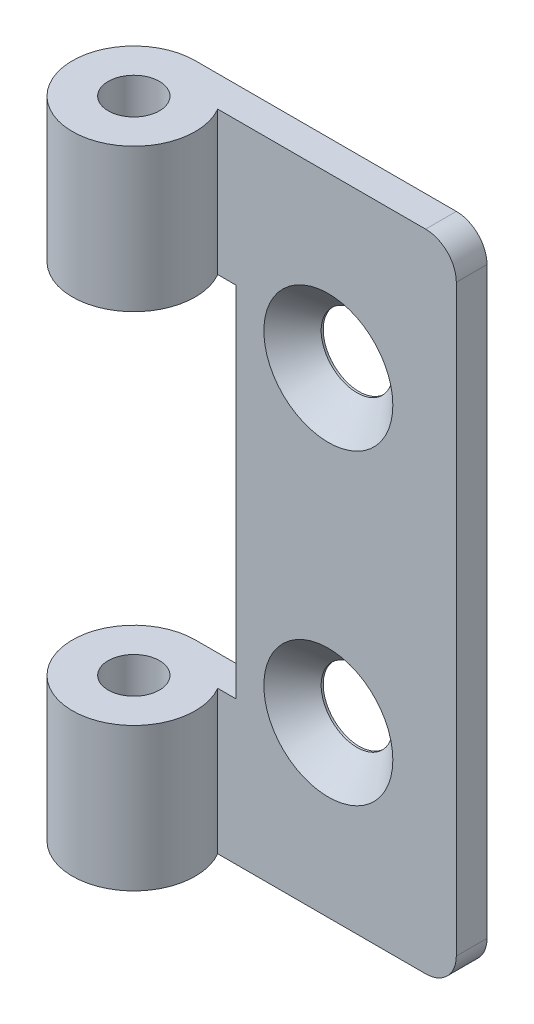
from build123d import *

# Parameters (mm, degrees)
EXTRUDE_1_DEPTH             = 31.5
SKETCH_2_W                  = 18.001338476
SKETCH_2_H                  = 35
CUT_EXTRUDE_2_DEPTH         = 45.141816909
FILLET_2_R                  = 3
HOLE_WIZARD_M6_1_AT_2_COUNT = 2
HOLE_WIZARD_M6_1_AT_2_PITCH = 30
SKETCH_5_R                  = 2.5
CUT_EXTRUDE_3_DEPTH         = 70.406411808


with BuildPart() as part:
    # Sketch 1 → Extrude 1 (new, symmetric)
    with BuildSketch(Plane(origin=(0, 0, 0), x_dir=(1, 0, 0), z_dir=(0, 1, 0))):
        with BuildLine():
            Line((0, 6), (28.5, 6))
            Line((28.5, 6), (28.5, 3))
            Line((28.5, 3), (5.196152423, 3))
            ThreePointArc((5.196152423, 3), (-3, -5.196152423), (0, 6))
        make_face()
    extrude(amount=EXTRUDE_1_DEPTH, both=True)

    # Sketch 2 → Cut-Extrude 2 (cut, through all)
    with BuildSketch(Plane(origin=(0, 0, -6), x_dir=(-1, 0, 0), z_dir=(0, 0, -1))):
        with Locations((2.000669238, 0)):
            Rectangle(SKETCH_2_W, SKETCH_2_H)
    extrude(amount=-CUT_EXTRUDE_2_DEPTH, mode=Mode.SUBTRACT)

    # Fillet 2
    fillet_2_edges = [part.edges().sort_by_distance(p)[0] for p in [
        (28.5, 31.5, -4.5),
        (28.5, -31.5, -4.5),
    ]]
    fillet(fillet_2_edges, radius=FILLET_2_R)

    # Sketch 4 → Hole Wizard M6 _1 (revolve, cut)
    with BuildSketch(Plane(origin=(16, 15, -3), x_dir=(0, -1, 0), z_dir=(1, 0, 0))):
        Polygon((0, 0), (0, 3), (3.5, 3), (3.5, 2.8), (6.3, 0), align=None)
    hole_wizard_m6_1 = revolve(axis=Axis((16, 15, 3.35), (0, 0, -1)), mode=Mode.SUBTRACT)

    # Hole Wizard M6 _1 at 2: Hole Wizard M6 _1 ×2
    with Locations(*[(0, -i * HOLE_WIZARD_M6_1_AT_2_PITCH, 0) for i in range(1, HOLE_WIZARD_M6_1_AT_2_COUNT)]):
        add(hole_wizard_m6_1, mode=Mode.SUBTRACT)

    # Sketch 5 → Cut-Extrude 3 (cut, through all)
    with BuildSketch(Plane(origin=(0, 31.5, 0), x_dir=(1, 0, 0), z_dir=(0, 1, 0))):
        with Locations(Location((0, 0, 0), (0, 0, 270))):
            Circle(SKETCH_5_R)
    extrude(amount=-CUT_EXTRUDE_3_DEPTH, mode=Mode.SUBTRACT)


solid = part.part
